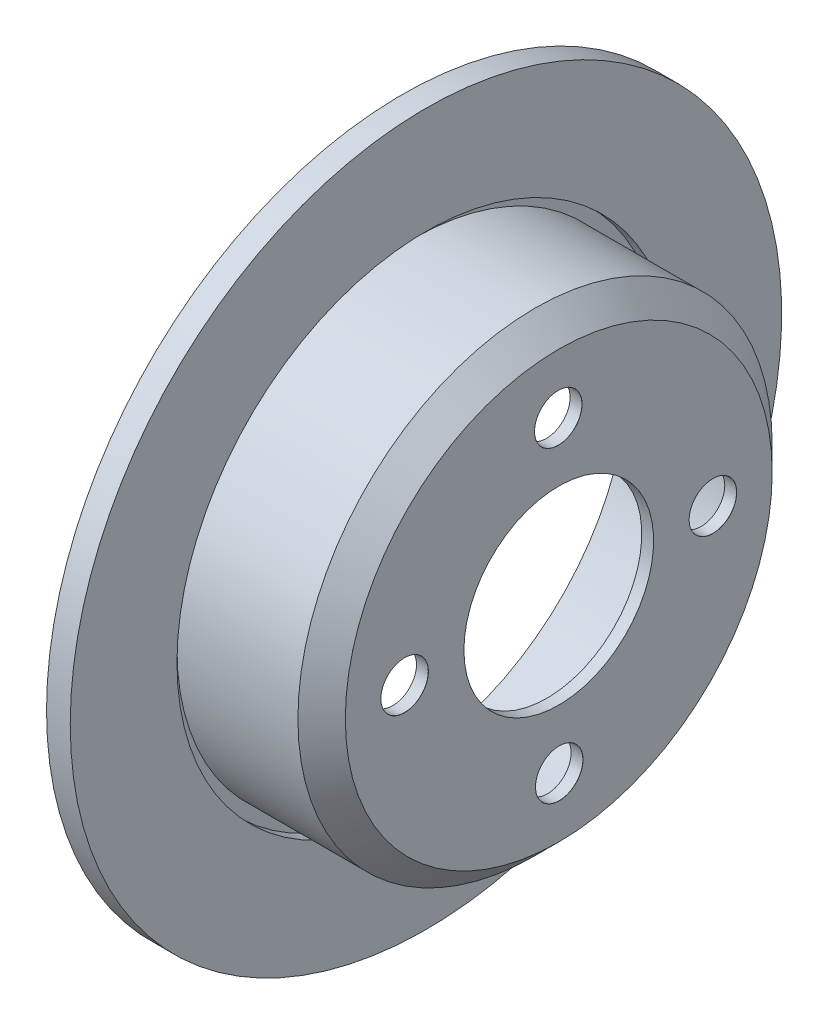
from build123d import *

# Parameters (mm, degrees)
F_20_0MM_DOWEL_HOLE1_D           = 20
F_20_0MM_DOWEL_HOLE1_CSINK_D     = 20.05
F_20_0MM_DOWEL_HOLE1_CSINK_ANGLE = 90
CIRPATTERN1_COUNT                = 4


with BuildPart() as part:
    # Sketch1 → Revolve1 (revolve)
    with BuildSketch(Plane.XY, mode=Mode.PRIVATE) as revolve1_sk:
        Polygon((0, 40), (0, 90), (-10, 100), (-61, 100), (-61, 105), (-56, 105), (-56, 150), (-66, 150), (-66, 95), (-12.071067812, 95), (-5, 87.928932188), (-5, 40), align=None)
    revolve(revolve1_sk.sketch.rotate(Axis((0, 0, 0), (1, 0, 0)), 90), axis=Axis((0, 0, 0), (1, 0, 0)))

    # 20.0mm Dowel Hole1 (through all)
    with Locations(Plane(origin=(0, 0.204401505, -64.999678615), x_dir=(0, 0, 1), z_dir=(1, 0, 0))):
        with Locations((0, 0)):
            f_20_0mm_dowel_hole1 = CounterSinkHole(F_20_0MM_DOWEL_HOLE1_D / 2, F_20_0MM_DOWEL_HOLE1_CSINK_D / 2, counter_sink_angle=F_20_0MM_DOWEL_HOLE1_CSINK_ANGLE)

    # CirPattern1: 20.0mm Dowel Hole1 ×4 about axis
    cirpattern1_axis = Axis((0, 0, 0), (1, 0, 0))
    for i in range(1, CIRPATTERN1_COUNT):
        add(f_20_0mm_dowel_hole1.rotate(cirpattern1_axis, i * 360 / CIRPATTERN1_COUNT), mode=Mode.SUBTRACT)


solid = part.part
